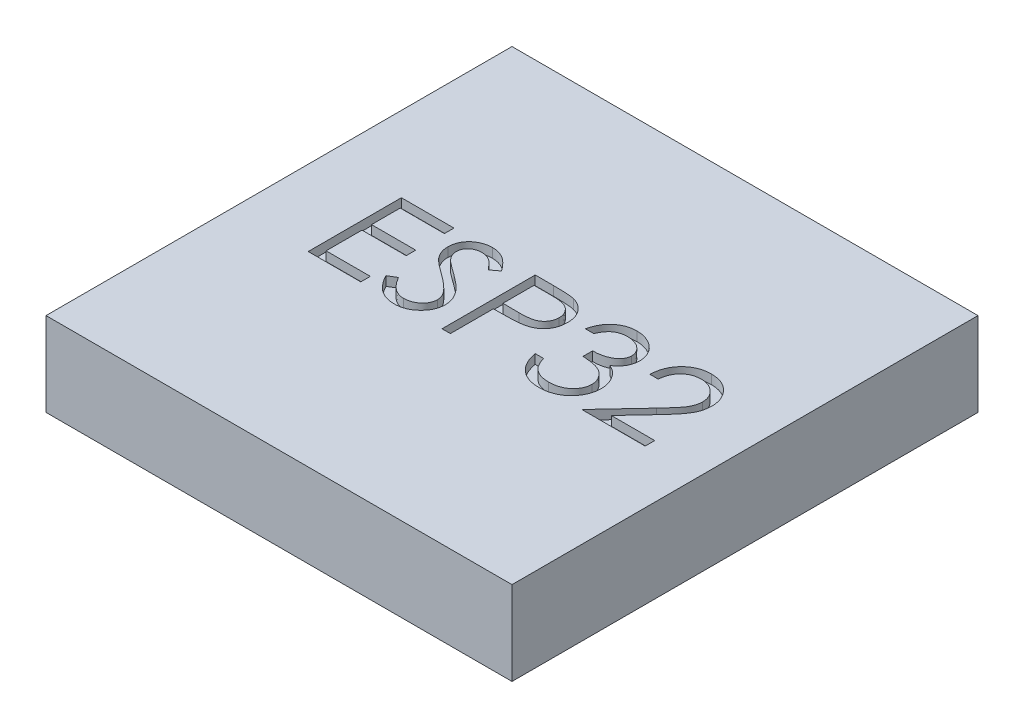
from build123d import *

# Parameters (mm, degrees)
SKETCH1_W           = 5
SKETCH1_H           = 5
BOSS_EXTRUDE1_DEPTH = 0.9
CUT_EXTRUDE1_DEPTH  = 0.1


with BuildPart() as part:
    # Sketch1 → Boss-Extrude1 (new body)
    with BuildSketch(Plane(origin=(0, 0, 0), x_dir=(1, 0, 0), z_dir=(0, 1, 0))):
        Rectangle(SKETCH1_W, SKETCH1_H)
    extrude(amount=BOSS_EXTRUDE1_DEPTH)

    # Sketch2 → Cut-Extrude1 (cut)
    # profile 1 of 5: a face of its own
    with BuildSketch(Plane(origin=(0, 0.9, 0), x_dir=(1, 0, 0), z_dir=(0, 1, 0))):
        Polygon((-1.688543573, 0.501822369), (-1.124441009, 0.501822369), (-1.124441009, 0.399258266), (-1.598799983, 0.399258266), (-1.598799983, 0.091565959), (-1.124441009, 0.091565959), (-1.124441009, -0.010998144), (-1.598799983, -0.010998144), (-1.598799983, -0.395613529), (-1.124441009, -0.395613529), (-1.124441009, -0.498177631), (-1.688543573, -0.498177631), align=None)
    # profile 2 of 5: a face of its own
    with BuildSketch(Plane(origin=(0, 0.9, 0), x_dir=(1, 0, 0), z_dir=(0, 1, 0))):
        with BuildLine():
            Line((-1.047517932, -0.305268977), (-0.962982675, -0.254587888))
            add(Edge.make_bspline(
                [(-0.962982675, -0.254587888), (-0.955120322, -0.26774914), (-0.940056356, -0.292965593), (-0.914927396, -0.327039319), (-0.888889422, -0.355999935), (-0.861749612, -0.379678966), (-0.833673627, -0.398321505), (-0.804478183, -0.411522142), (-0.774261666, -0.419755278), (-0.753697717, -0.420755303), (-0.743431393, -0.421254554)],
                knots=[0, 0, 0, 0, 1.272034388, 2.437168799, 3.508375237, 4.49857839, 5.41946034, 6.295179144, 7.148887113, 8, 8, 8, 8], degree=3))
            add(Edge.make_bspline(
                [(-0.743431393, -0.421254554), (-0.734663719, -0.421010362), (-0.717281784, -0.420526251), (-0.691692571, -0.415874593), (-0.666840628, -0.40872827), (-0.64323816, -0.398493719), (-0.621210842, -0.386111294), (-0.601894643, -0.371155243), (-0.585195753, -0.354410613), (-0.571536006, -0.335729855), (-0.561055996, -0.315639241), (-0.55300112, -0.29501754), (-0.548531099, -0.273540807), (-0.54785774, -0.259080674), (-0.547517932, -0.2517834)],
                knots=[0, 0, 0, 0, 1.095163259, 2.171163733, 3.241058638, 4.321873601, 5.38011039, 6.391990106, 7.366004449, 8.327778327, 9.272591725, 10.192022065, 11.087607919, 12, 12, 12, 12], degree=3))
            add(Edge.make_bspline(
                [(-0.547517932, -0.2517834), (-0.547939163, -0.243457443), (-0.548795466, -0.226531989), (-0.556033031, -0.20156066), (-0.567418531, -0.176848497), (-0.577922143, -0.161562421), (-0.583375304, -0.153626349)],
                knots=[0, 0, 0, 0, 0.938893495, 1.908633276, 2.914225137, 4, 4, 4, 4], degree=3))
            add(Edge.make_bspline(
                [(-0.583375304, -0.153626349), (-0.587852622, -0.147898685), (-0.597252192, -0.135874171), (-0.613411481, -0.117975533), (-0.632373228, -0.099513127), (-0.653488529, -0.079781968), (-0.677526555, -0.059699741), (-0.703734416, -0.038308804), (-0.732781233, -0.016422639), (-0.753152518, -0.001744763), (-0.763663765, 0.005828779)],
                knots=[0, 0, 0, 0, 0.722233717, 1.516239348, 2.393582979, 3.351407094, 4.387010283, 5.505090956, 6.712668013, 8, 8, 8, 8], degree=3))
            add(Edge.make_bspline(
                [(-0.763663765, 0.005828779), (-0.774184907, 0.013322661), (-0.794300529, 0.027650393), (-0.822431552, 0.048914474), (-0.847587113, 0.06835558), (-0.869655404, 0.086156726), (-0.888626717, 0.102320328), (-0.904650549, 0.116691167), (-0.917318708, 0.129657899), (-0.924363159, 0.138069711), (-0.927525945, 0.141846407)],
                knots=[0, 0, 0, 0, 1.452282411, 2.77665338, 3.964542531, 5.026858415, 5.96415736, 6.766646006, 7.446254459, 8, 8, 8, 8], degree=3))
            add(Edge.make_bspline(
                [(-0.927525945, 0.141846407), (-0.931946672, 0.147732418), (-0.940640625, 0.159308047), (-0.952116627, 0.177400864), (-0.961870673, 0.195921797), (-0.969517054, 0.214920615), (-0.975955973, 0.234130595), (-0.980286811, 0.25380238), (-0.982998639, 0.273847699), (-0.983276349, 0.287337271), (-0.983415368, 0.294089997)],
                knots=[0, 0, 0, 0, 1.068054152, 2.10047183, 3.106115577, 4.101338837, 5.06977816, 6.043150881, 7.020423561, 8, 8, 8, 8], degree=3))
            add(Edge.make_bspline(
                [(-0.983415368, 0.294089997), (-0.983042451, 0.304669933), (-0.982304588, 0.325603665), (-0.97606444, 0.356183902), (-0.966215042, 0.385380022), (-0.952416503, 0.412902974), (-0.934628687, 0.438036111), (-0.914044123, 0.461068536), (-0.889526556, 0.480430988), (-0.862625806, 0.497348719), (-0.833181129, 0.510590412), (-0.802326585, 0.520579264), (-0.770013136, 0.526239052), (-0.748126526, 0.52705127), (-0.737021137, 0.527463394)],
                knots=[0, 0, 0, 0, 1.005424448, 1.989358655, 2.955360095, 3.929531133, 4.905563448, 5.876582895, 6.856512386, 7.866279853, 8.892233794, 9.918561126, 10.94386622, 12, 12, 12, 12], degree=3))
            add(Edge.make_bspline(
                [(-0.737021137, 0.527463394), (-0.725237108, 0.527056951), (-0.701802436, 0.526248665), (-0.667331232, 0.519220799), (-0.634142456, 0.507592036), (-0.60744438, 0.494395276), (-0.586549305, 0.481214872), (-0.570614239, 0.469209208), (-0.554466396, 0.455387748), (-0.537975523, 0.439713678), (-0.521421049, 0.422043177), (-0.504557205, 0.402497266), (-0.487344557, 0.381195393), (-0.476271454, 0.365988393), (-0.470594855, 0.358192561)],
                knots=[0, 0, 0, 0, 1.286793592, 2.559021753, 3.825965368, 5.121522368, 5.803751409, 6.523245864, 7.299691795, 8.125521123, 9.008227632, 9.944561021, 10.946284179, 12, 12, 12, 12], degree=3))
            Line((-0.470594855, 0.358192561), (-0.551724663, 0.296694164))
            add(Edge.make_bspline(
                [(-0.551724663, 0.296694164), (-0.5566235, 0.303005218), (-0.566057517, 0.315158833), (-0.580380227, 0.332179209), (-0.593879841, 0.347726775), (-0.607179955, 0.361231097), (-0.619578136, 0.373431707), (-0.631611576, 0.383877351), (-0.643107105, 0.392670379), (-0.657597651, 0.402054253), (-0.675802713, 0.411356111), (-0.698655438, 0.419227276), (-0.722537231, 0.423957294), (-0.73880284, 0.42458269), (-0.747037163, 0.424899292)],
                knots=[0, 0, 0, 0, 1.181633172, 2.275549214, 3.290209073, 4.226197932, 5.078386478, 5.862611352, 6.581680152, 7.217281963, 8.414376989, 9.595101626, 10.782541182, 12, 12, 12, 12], degree=3))
            add(Edge.make_bspline(
                [(-0.747037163, 0.424899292), (-0.757367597, 0.424553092), (-0.777288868, 0.423885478), (-0.805571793, 0.416594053), (-0.8310272, 0.405113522), (-0.852899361, 0.389023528), (-0.871109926, 0.369960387), (-0.884282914, 0.348023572), (-0.892211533, 0.323800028), (-0.893179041, 0.306902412), (-0.893671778, 0.298296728)],
                knots=[0, 0, 0, 0, 1.14458467, 2.207223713, 3.21896685, 4.227309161, 5.202851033, 6.127160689, 7.046193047, 8, 8, 8, 8], degree=3))
            add(Edge.make_bspline(
                [(-0.893671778, 0.298296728), (-0.893559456, 0.292939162), (-0.893334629, 0.282215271), (-0.890198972, 0.266372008), (-0.886170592, 0.250568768), (-0.879786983, 0.234876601), (-0.870974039, 0.21902107), (-0.859401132, 0.202729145), (-0.8448259, 0.185857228), (-0.833661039, 0.174883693), (-0.827766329, 0.169089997)],
                knots=[0, 0, 0, 0, 0.858281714, 1.717966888, 2.583508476, 3.4729293, 4.427298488, 5.488583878, 6.674047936, 8, 8, 8, 8], degree=3))
            add(Edge.make_bspline(
                [(-0.827766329, 0.169089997), (-0.825577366, 0.167136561), (-0.820376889, 0.162495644), (-0.810869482, 0.15489785), (-0.798314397, 0.145525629), (-0.783039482, 0.133929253), (-0.764763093, 0.120477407), (-0.74348322, 0.105342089), (-0.719437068, 0.088031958), (-0.702373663, 0.075929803), (-0.693351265, 0.069530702)],
                knots=[0, 0, 0, 0, 0.420754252, 0.999615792, 1.744751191, 2.668019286, 3.750313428, 4.999500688, 6.413464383, 8, 8, 8, 8], degree=3))
            add(Edge.make_bspline(
                [(-0.693351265, 0.069530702), (-0.682498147, 0.061633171), (-0.661482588, 0.046340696), (-0.631580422, 0.023364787), (-0.604467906, 0.000893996), (-0.580049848, -0.020928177), (-0.558085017, -0.041936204), (-0.538817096, -0.062382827), (-0.522049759, -0.082121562), (-0.503998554, -0.107428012), (-0.485553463, -0.138508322), (-0.469713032, -0.176587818), (-0.459724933, -0.214815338), (-0.458418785, -0.24050872), (-0.457774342, -0.253185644)],
                knots=[0, 0, 0, 0, 1.163667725, 2.253281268, 3.268753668, 4.215851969, 5.092017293, 5.902905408, 6.650798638, 7.335211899, 8.59617414, 9.77448103, 10.901945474, 12, 12, 12, 12], degree=3))
            add(Edge.make_bspline(
                [(-0.457774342, -0.253185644), (-0.457962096, -0.262150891), (-0.458333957, -0.279907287), (-0.462608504, -0.305980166), (-0.468871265, -0.331303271), (-0.478310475, -0.355563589), (-0.489831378, -0.37920495), (-0.504450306, -0.401607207), (-0.521395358, -0.423266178), (-0.540833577, -0.443604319), (-0.562103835, -0.46227466), (-0.58458489, -0.478882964), (-0.60831354, -0.492731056), (-0.633161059, -0.504031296), (-0.659133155, -0.512869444), (-0.686221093, -0.519273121), (-0.714469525, -0.523203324), (-0.733669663, -0.523611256), (-0.743431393, -0.523818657)],
                knots=[0, 0, 0, 0, 0.983748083, 1.948392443, 2.894712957, 3.844097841, 4.80183111, 5.778335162, 6.776009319, 7.81870978, 8.863265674, 9.881300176, 10.883814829, 11.87499822, 12.874611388, 13.892143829, 14.928324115, 16, 16, 16, 16], degree=3))
            add(Edge.make_bspline(
                [(-0.743431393, -0.523818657), (-0.750984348, -0.523672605), (-0.765995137, -0.523382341), (-0.788197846, -0.52081626), (-0.809952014, -0.517185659), (-0.830984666, -0.511421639), (-0.851566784, -0.504428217), (-0.871608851, -0.495817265), (-0.891120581, -0.485498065), (-0.910211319, -0.473699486), (-0.928832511, -0.459968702), (-0.946809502, -0.443976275), (-0.964732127, -0.426163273), (-0.982071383, -0.406045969), (-0.999177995, -0.383949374), (-1.015714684, -0.35966675), (-1.032023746, -0.333330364), (-1.042256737, -0.314797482), (-1.047517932, -0.305268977)],
                knots=[0, 0, 0, 0, 0.915332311, 1.819136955, 2.706846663, 3.586547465, 4.459518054, 5.340707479, 6.227863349, 7.133153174, 8.059268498, 9.028702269, 10.047606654, 11.120612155, 12.245963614, 13.433783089, 14.680604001, 16, 16, 16, 16], degree=3))
        make_face()
    # profile 3 of 5: a face of its own
    with BuildSketch(Plane(origin=(0, 0.9, 0), x_dir=(1, 0, 0), z_dir=(0, 1, 0))):
        with BuildLine():
            Line((-0.252646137, 0.501822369), (-0.056532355, 0.501822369))
            add(Edge.make_bspline(
                [(-0.056532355, 0.501822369), (-0.043043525, 0.501807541), (-0.017198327, 0.501779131), (0.019863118, 0.500917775), (0.053523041, 0.499767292), (0.083708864, 0.498172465), (0.110513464, 0.496287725), (0.133815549, 0.493644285), (0.15379828, 0.490884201), (0.165771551, 0.488078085), (0.171232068, 0.48679833)],
                knots=[0, 0, 0, 0, 1.415646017, 2.712440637, 3.8905458, 4.950247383, 5.884950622, 6.709939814, 7.411656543, 8, 8, 8, 8], degree=3))
            add(Edge.make_bspline(
                [(0.171232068, 0.48679833), (0.178144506, 0.484906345), (0.1918065, 0.481166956), (0.211492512, 0.47367732), (0.230222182, 0.464796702), (0.248059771, 0.454675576), (0.26478608, 0.442879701), (0.280650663, 0.429887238), (0.295513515, 0.415398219), (0.309291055, 0.39957515), (0.321943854, 0.382683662), (0.33283805, 0.364471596), (0.341960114, 0.345245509), (0.349783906, 0.325018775), (0.355414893, 0.303621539), (0.359656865, 0.281202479), (0.36234933, 0.257763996), (0.362607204, 0.241746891), (0.362738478, 0.233593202)],
                knots=[0, 0, 0, 0, 0.999701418, 1.975846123, 2.934577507, 3.890451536, 4.834027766, 5.787354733, 6.749476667, 7.726910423, 8.712836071, 9.690891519, 10.682875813, 11.679750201, 12.712814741, 13.765529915, 14.8625177, 16, 16, 16, 16], degree=3))
            add(Edge.make_bspline(
                [(0.362738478, 0.233593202), (0.362618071, 0.22537098), (0.362382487, 0.209283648), (0.359554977, 0.185748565), (0.355746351, 0.163257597), (0.34989005, 0.141860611), (0.342219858, 0.121684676), (0.333222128, 0.102421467), (0.322369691, 0.084398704), (0.30989974, 0.067550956), (0.296027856, 0.05186241), (0.28081273, 0.037446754), (0.26431579, 0.024388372), (0.246589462, 0.012657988), (0.227460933, 0.002527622), (0.207220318, -0.006545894), (0.185691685, -0.014166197), (0.170793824, -0.018174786), (0.163219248, -0.020212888)],
                knots=[0, 0, 0, 0, 1.121902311, 2.195077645, 3.232258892, 4.234102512, 5.217864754, 6.176164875, 7.132989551, 8.084763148, 9.034132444, 9.988522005, 10.94243251, 11.903244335, 12.886203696, 13.894208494, 14.929344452, 16, 16, 16, 16], degree=3))
            add(Edge.make_bspline(
                [(0.163219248, -0.020212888), (0.156954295, -0.021545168), (0.143224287, -0.024464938), (0.120612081, -0.027724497), (0.094284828, -0.030506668), (0.064278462, -0.032592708), (0.030619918, -0.034378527), (-0.006709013, -0.035797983), (-0.047781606, -0.036577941), (-0.076430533, -0.036618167), (-0.091388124, -0.03663917)],
                knots=[0, 0, 0, 0, 0.601384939, 1.31797006, 2.144135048, 3.087295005, 4.142315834, 5.309527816, 6.595305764, 8, 8, 8, 8], degree=3))
            Line((-0.091388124, -0.03663917), (-0.162902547, -0.03663917))
            Line((-0.162902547, -0.03663917), (-0.162902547, -0.498177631))
            Line((-0.162902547, -0.498177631), (-0.252646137, -0.498177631))
            Line((-0.252646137, -0.498177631), (-0.252646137, 0.501822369))
        make_face()
        with BuildLine():
            Line((-0.162902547, 0.399258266), (-0.162902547, 0.065924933))
            Line((-0.162902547, 0.065924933), (0.012177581, 0.063721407))
            add(Edge.make_bspline(
                [(0.012177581, 0.063721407), (0.020726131, 0.063716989), (0.037228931, 0.06370846), (0.061067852, 0.064847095), (0.083184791, 0.066161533), (0.103511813, 0.068086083), (0.12205808, 0.070806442), (0.138854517, 0.073552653), (0.153770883, 0.077525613), (0.171227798, 0.082875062), (0.190680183, 0.091998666), (0.21184234, 0.105241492), (0.229776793, 0.122121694), (0.245296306, 0.141101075), (0.257612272, 0.162215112), (0.266628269, 0.184806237), (0.271925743, 0.208642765), (0.272636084, 0.224953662), (0.272994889, 0.233192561)],
                knots=[0, 0, 0, 0, 1.160613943, 2.240541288, 3.23993089, 4.169200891, 5.011653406, 5.7853311, 6.478053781, 7.106038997, 8.262395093, 9.384106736, 10.481365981, 11.59014053, 12.70357646, 13.786202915, 14.881775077, 16, 16, 16, 16], degree=3))
            add(Edge.make_bspline(
                [(0.272994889, 0.233192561), (0.272634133, 0.241232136), (0.271916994, 0.257213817), (0.266586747, 0.28063632), (0.257629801, 0.302989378), (0.245213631, 0.323838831), (0.230144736, 0.342749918), (0.212630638, 0.359177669), (0.192712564, 0.37238387), (0.174184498, 0.380907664), (0.157727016, 0.386112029), (0.14343217, 0.389753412), (0.127291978, 0.392660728), (0.109301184, 0.395014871), (0.089599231, 0.397030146), (0.068016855, 0.398397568), (0.044635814, 0.399197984), (0.028404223, 0.399237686), (0.019990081, 0.399258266)],
                knots=[0, 0, 0, 0, 1.120700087, 2.227813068, 3.331159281, 4.466773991, 5.599788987, 6.693661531, 7.80175334, 8.91857717, 9.525282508, 10.207424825, 10.974604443, 11.810962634, 12.737642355, 13.736264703, 14.826523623, 16, 16, 16, 16], degree=3))
            Line((0.019990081, 0.399258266), (-0.162902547, 0.399258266))
        make_face(mode=Mode.SUBTRACT)
    # profile 4 of 5: a face of its own
    with BuildSketch(Plane(origin=(0, 0.9, 0), x_dir=(1, 0, 0), z_dir=(0, 1, 0))):
        with BuildLine():
            Line((0.606328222, 0.271053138), (0.516584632, 0.271053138))
            add(Edge.make_bspline(
                [(0.516584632, 0.271053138), (0.519015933, 0.281119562), (0.523768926, 0.300798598), (0.533682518, 0.328914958), (0.544482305, 0.355521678), (0.557450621, 0.380120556), (0.571595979, 0.403205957), (0.587802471, 0.424254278), (0.605322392, 0.44380084), (0.624700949, 0.461147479), (0.645023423, 0.476855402), (0.666576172, 0.490248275), (0.68892557, 0.501769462), (0.712226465, 0.511260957), (0.736548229, 0.518411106), (0.761670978, 0.523598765), (0.78766055, 0.526967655), (0.805302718, 0.527296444), (0.814260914, 0.527463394)],
                knots=[0, 0, 0, 0, 1.162005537, 2.271625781, 3.343758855, 4.383309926, 5.390229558, 6.379919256, 7.361854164, 8.333198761, 9.295911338, 10.242430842, 11.177959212, 12.116337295, 13.062827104, 14.020064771, 14.994644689, 16, 16, 16, 16], degree=3))
            add(Edge.make_bspline(
                [(0.814260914, 0.527463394), (0.827313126, 0.527069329), (0.853132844, 0.526289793), (0.891065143, 0.519171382), (0.927644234, 0.507907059), (0.962469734, 0.492343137), (0.994817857, 0.473146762), (1.023599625, 0.450299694), (1.048424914, 0.424242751), (1.069251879, 0.395462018), (1.085559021, 0.364703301), (1.097583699, 0.333046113), (1.10490418, 0.30056555), (1.10585291, 0.278634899), (1.106328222, 0.267647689)],
                knots=[0, 0, 0, 0, 1.083050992, 2.142477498, 3.193116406, 4.255571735, 5.30263384, 6.308962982, 7.297363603, 8.282367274, 9.249857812, 10.179914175, 11.08814088, 12, 12, 12, 12], degree=3))
            add(Edge.make_bspline(
                [(1.106328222, 0.267647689), (1.105995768, 0.257074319), (1.105345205, 0.236383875), (1.09982129, 0.206177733), (1.090525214, 0.177708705), (1.077648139, 0.150856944), (1.060979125, 0.125792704), (1.040786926, 0.102459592), (1.016929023, 0.080754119), (0.998849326, 0.068319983), (0.989541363, 0.061918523)],
                knots=[0, 0, 0, 0, 1.024540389, 2.004866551, 2.965041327, 3.920577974, 4.882998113, 5.874504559, 6.905732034, 8, 8, 8, 8], degree=3))
            add(Edge.make_bspline(
                [(0.989541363, 0.061918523), (1.000179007, 0.056781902), (1.021255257, 0.046604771), (1.04998398, 0.026645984), (1.076063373, 0.003601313), (1.090607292, -0.014382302), (1.097914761, -0.023418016)],
                knots=[0, 0, 0, 0, 1.015518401, 2.012035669, 3.001164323, 4, 4, 4, 4], degree=3))
            add(Edge.make_bspline(
                [(1.097914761, -0.023418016), (1.102726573, -0.030005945), (1.1122714, -0.043073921), (1.124052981, -0.064084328), (1.1347413, -0.085327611), (1.143069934, -0.107373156), (1.14951961, -0.129965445), (1.154129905, -0.153143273), (1.156993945, -0.176925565), (1.157404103, -0.193014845), (1.157610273, -0.201102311)],
                knots=[0, 0, 0, 0, 1.025084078, 2.033381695, 3.024893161, 4.013698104, 4.991890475, 5.976764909, 6.982997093, 8, 8, 8, 8], degree=3))
            add(Edge.make_bspline(
                [(1.157610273, -0.201102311), (1.157097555, -0.215105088), (1.156074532, -0.243044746), (1.146930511, -0.284323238), (1.132755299, -0.324673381), (1.112624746, -0.363266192), (1.088091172, -0.399374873), (1.058903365, -0.43168239), (1.025392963, -0.459453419), (0.98801992, -0.482656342), (0.947529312, -0.50120432), (0.904222, -0.514077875), (0.858721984, -0.522462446), (0.827519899, -0.523361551), (0.811656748, -0.523818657)],
                knots=[0, 0, 0, 0, 0.955779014, 1.907060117, 2.875433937, 3.871313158, 4.872415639, 5.851225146, 6.836215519, 7.83643374, 8.849228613, 9.86973379, 10.916971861, 12, 12, 12, 12], degree=3))
            add(Edge.make_bspline(
                [(0.811656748, -0.523818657), (0.800965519, -0.523570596), (0.779928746, -0.523082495), (0.749002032, -0.519745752), (0.719481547, -0.513651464), (0.691327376, -0.50545052), (0.664514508, -0.495052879), (0.639124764, -0.48210468), (0.615001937, -0.466872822), (0.592373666, -0.449177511), (0.571242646, -0.429382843), (0.552170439, -0.407137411), (0.53483907, -0.382852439), (0.519712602, -0.356245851), (0.506102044, -0.327661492), (0.494907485, -0.29673335), (0.485054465, -0.263737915), (0.480473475, -0.240744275), (0.478123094, -0.228946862)],
                knots=[0, 0, 0, 0, 1.048658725, 2.063410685, 3.046034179, 4.001477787, 4.936774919, 5.862367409, 6.792675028, 7.730719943, 8.675894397, 9.627829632, 10.600096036, 11.597688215, 12.626045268, 13.701542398, 14.82072376, 16, 16, 16, 16], degree=3))
            Line((0.478123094, -0.228946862), (0.567866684, -0.228946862))
            add(Edge.make_bspline(
                [(0.567866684, -0.228946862), (0.570204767, -0.23664658), (0.574752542, -0.251623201), (0.58249377, -0.273177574), (0.591313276, -0.292937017), (0.600774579, -0.311046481), (0.610711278, -0.32768431), (0.621829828, -0.342410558), (0.633306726, -0.355872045), (0.64195797, -0.36345622), (0.646192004, -0.367168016)],
                knots=[0, 0, 0, 0, 1.198163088, 2.33053128, 3.407730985, 4.417276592, 5.372219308, 6.28897303, 7.162600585, 8, 8, 8, 8], degree=3))
            add(Edge.make_bspline(
                [(0.646192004, -0.367168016), (0.651791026, -0.371484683), (0.662971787, -0.380104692), (0.681191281, -0.391105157), (0.700352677, -0.400636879), (0.720871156, -0.407917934), (0.742303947, -0.41408298), (0.76499748, -0.418117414), (0.788751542, -0.420885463), (0.804970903, -0.42112973), (0.813259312, -0.421254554)],
                knots=[0, 0, 0, 0, 0.946170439, 1.889420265, 2.845303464, 3.807233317, 4.801018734, 5.828864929, 6.890507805, 8, 8, 8, 8], degree=3))
            add(Edge.make_bspline(
                [(0.813259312, -0.421254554), (0.822617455, -0.421078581), (0.840916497, -0.420734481), (0.867617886, -0.417569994), (0.893020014, -0.412961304), (0.91684085, -0.405843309), (0.939392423, -0.39704878), (0.960358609, -0.386006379), (0.980014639, -0.373050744), (0.998108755, -0.35832527), (1.0143789, -0.342204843), (1.028704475, -0.325343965), (1.04088295, -0.307813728), (1.050706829, -0.289517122), (1.058464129, -0.270529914), (1.063745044, -0.25079882), (1.067416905, -0.230485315), (1.067715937, -0.216677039), (1.067866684, -0.209716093)],
                knots=[0, 0, 0, 0, 1.217147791, 2.380027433, 3.494444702, 4.572153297, 5.609568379, 6.639424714, 7.649109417, 8.668170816, 9.669597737, 10.625200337, 11.543417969, 12.441394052, 13.322311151, 14.205496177, 15.095365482, 16, 16, 16, 16], degree=3))
            add(Edge.make_bspline(
                [(1.067866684, -0.209716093), (1.067429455, -0.200398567), (1.066557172, -0.181809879), (1.059897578, -0.154462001), (1.048943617, -0.128112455), (1.033608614, -0.1032108), (1.014941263, -0.080131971), (0.993122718, -0.059540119), (0.967971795, -0.042548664), (0.944823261, -0.030809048), (0.924318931, -0.022798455), (0.906771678, -0.017462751), (0.887126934, -0.012944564), (0.865622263, -0.008741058), (0.84209563, -0.00516353), (0.816572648, -0.002180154), (0.789048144, 0.000207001), (0.769993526, 0.001273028), (0.760174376, 0.001822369)],
                knots=[0, 0, 0, 0, 1.07054697, 2.135767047, 3.216561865, 4.33974944, 5.486079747, 6.621378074, 7.775625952, 8.963672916, 9.598146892, 10.304877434, 11.070270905, 11.915000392, 12.823868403, 13.805723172, 14.86925407, 16, 16, 16, 16], degree=3))
            Line((0.760174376, 0.001822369), (0.760174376, 0.104386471))
            add(Edge.make_bspline(
                [(0.760174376, 0.104386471), (0.772546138, 0.104596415), (0.796779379, 0.105007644), (0.832177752, 0.109981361), (0.86602727, 0.116861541), (0.897577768, 0.127400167), (0.926334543, 0.139640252), (0.951283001, 0.15388374), (0.972073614, 0.169716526), (0.988605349, 0.187382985), (1.001042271, 0.206330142), (1.010135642, 0.226077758), (1.015507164, 0.246798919), (1.016224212, 0.260940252), (1.016584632, 0.26804833)],
                knots=[0, 0, 0, 0, 1.321986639, 2.589447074, 3.816329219, 5.01088745, 6.139805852, 7.153945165, 8.075214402, 8.924034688, 9.728124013, 10.488707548, 11.240355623, 12, 12, 12, 12], degree=3))
            add(Edge.make_bspline(
                [(1.016584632, 0.26804833), (1.016466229, 0.273270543), (1.016230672, 0.283659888), (1.013260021, 0.298838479), (1.008796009, 0.313553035), (1.002658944, 0.327740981), (0.994444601, 0.341303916), (0.984614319, 0.354357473), (0.972909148, 0.366827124), (0.959496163, 0.378450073), (0.94509279, 0.389526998), (0.92930714, 0.398930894), (0.912615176, 0.40697234), (0.894998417, 0.413603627), (0.876399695, 0.418591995), (0.856906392, 0.422173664), (0.83648134, 0.424412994), (0.822546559, 0.424735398), (0.815462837, 0.424899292)],
                knots=[0, 0, 0, 0, 0.884392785, 1.759457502, 2.611959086, 3.489218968, 4.37281399, 5.2945488, 6.255912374, 7.266815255, 8.301784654, 9.332968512, 10.37626691, 11.440494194, 12.520033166, 13.637162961, 14.798855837, 16, 16, 16, 16], degree=3))
            add(Edge.make_bspline(
                [(0.815462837, 0.424899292), (0.804076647, 0.42450176), (0.781836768, 0.423725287), (0.749775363, 0.416924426), (0.719969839, 0.406073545), (0.697187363, 0.393121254), (0.68036377, 0.380335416), (0.668341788, 0.36916902), (0.656535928, 0.356759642), (0.645722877, 0.342342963), (0.634787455, 0.326895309), (0.624831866, 0.3096314), (0.615157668, 0.291001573), (0.609328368, 0.277831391), (0.606328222, 0.271053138)],
                knots=[0, 0, 0, 0, 1.472543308, 2.876219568, 4.221790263, 5.565193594, 6.249813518, 6.953379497, 7.687249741, 8.463570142, 9.283606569, 10.136032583, 11.040678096, 12, 12, 12, 12], degree=3))
        make_face()
    # profile 5 of 5: a face of its own
    with BuildSketch(Plane(origin=(0, 0.9, 0), x_dir=(1, 0, 0), z_dir=(0, 1, 0))):
        with BuildLine():
            Line((1.375558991, 0.194130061), (1.285815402, 0.194130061))
            add(Edge.make_bspline(
                [(1.285815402, 0.194130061), (1.286400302, 0.206036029), (1.287549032, 0.229419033), (1.292928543, 0.263511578), (1.300625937, 0.296098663), (1.311509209, 0.326918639), (1.325025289, 0.356244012), (1.341233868, 0.383958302), (1.360432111, 0.409955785), (1.382205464, 0.433995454), (1.405853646, 0.456049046), (1.431369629, 0.475093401), (1.458182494, 0.491184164), (1.486210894, 0.504635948), (1.515771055, 0.514733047), (1.546594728, 0.522224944), (1.578817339, 0.526732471), (1.600771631, 0.527216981), (1.611937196, 0.527463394)],
                knots=[0, 0, 0, 0, 1.10065271, 2.161652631, 3.183658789, 4.190468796, 5.17591951, 6.163126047, 7.15150782, 8.156236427, 9.156009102, 10.134482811, 11.092018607, 12.041330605, 13.001268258, 13.972401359, 14.968799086, 16, 16, 16, 16], degree=3))
            add(Edge.make_bspline(
                [(1.611937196, 0.527463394), (1.62290236, 0.527206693), (1.644448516, 0.526702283), (1.675894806, 0.52237056), (1.705831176, 0.515586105), (1.734199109, 0.506067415), (1.76077227, 0.493271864), (1.785750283, 0.477901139), (1.809430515, 0.460124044), (1.830746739, 0.439194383), (1.850320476, 0.416850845), (1.867206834, 0.392997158), (1.881667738, 0.368360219), (1.893721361, 0.342752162), (1.902594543, 0.315931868), (1.909331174, 0.28828981), (1.913139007, 0.259539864), (1.913723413, 0.240080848), (1.91402053, 0.230187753)],
                knots=[0, 0, 0, 0, 1.111607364, 2.184268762, 3.212621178, 4.221274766, 5.211760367, 6.196651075, 7.1921475, 8.207485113, 9.220403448, 10.201281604, 11.166441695, 12.114753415, 13.065576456, 14.026450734, 14.996634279, 16, 16, 16, 16], degree=3))
            add(Edge.make_bspline(
                [(1.91402053, 0.230187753), (1.913538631, 0.216259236), (1.912583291, 0.188646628), (1.904338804, 0.148016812), (1.891601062, 0.108615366), (1.876151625, 0.076907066), (1.860545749, 0.051485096), (1.846780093, 0.030366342), (1.830307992, 0.007844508), (1.81128016, -0.016307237), (1.789983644, -0.042162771), (1.766265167, -0.069732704), (1.739943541, -0.09872422), (1.721469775, -0.118525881), (1.711897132, -0.128786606)],
                knots=[0, 0, 0, 0, 1.184203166, 2.347625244, 3.513805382, 4.700623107, 5.337941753, 6.051866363, 6.845199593, 7.711357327, 8.668078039, 9.695487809, 10.805859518, 12, 12, 12, 12], degree=3))
            Line((1.711897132, -0.128786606), (1.461696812, -0.395613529))
            Line((1.461696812, -0.395613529), (1.926841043, -0.395613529))
            Line((1.926841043, -0.395613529), (1.926841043, -0.498177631))
            Line((1.926841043, -0.498177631), (1.247353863, -0.498177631))
            Line((1.247353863, -0.498177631), (1.635174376, -0.084315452))
            add(Edge.make_bspline(
                [(1.635174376, -0.084315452), (1.644616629, -0.074458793), (1.662753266, -0.055526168), (1.68840543, -0.027885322), (1.711445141, -0.002242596), (1.732021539, 0.02135356), (1.749688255, 0.043248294), (1.765366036, 0.062732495), (1.777927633, 0.080662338), (1.791560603, 0.101445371), (1.804764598, 0.126820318), (1.816110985, 0.157829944), (1.823029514, 0.189752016), (1.823859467, 0.211324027), (1.82427694, 0.222174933)],
                knots=[0, 0, 0, 0, 1.329631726, 2.553950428, 3.673215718, 4.687767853, 5.603093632, 6.413772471, 7.123043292, 7.734684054, 8.834405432, 9.900288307, 10.943827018, 12, 12, 12, 12], degree=3))
            add(Edge.make_bspline(
                [(1.82427694, 0.222174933), (1.824095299, 0.22899819), (1.823737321, 0.242445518), (1.820577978, 0.262161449), (1.815803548, 0.281179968), (1.808962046, 0.299559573), (1.799931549, 0.317115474), (1.788939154, 0.333869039), (1.776256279, 0.350065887), (1.761584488, 0.365252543), (1.745466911, 0.379161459), (1.728439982, 0.391482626), (1.710425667, 0.401779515), (1.691499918, 0.410220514), (1.671715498, 0.416842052), (1.651034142, 0.421430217), (1.629512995, 0.424310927), (1.61481771, 0.42470069), (1.607329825, 0.424899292)],
                knots=[0, 0, 0, 0, 0.991446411, 1.95395049, 2.89581595, 3.838931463, 4.798493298, 5.75982156, 6.748411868, 7.785213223, 8.824556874, 9.840280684, 10.836137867, 11.835679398, 12.848801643, 13.863922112, 14.911575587, 16, 16, 16, 16], degree=3))
            add(Edge.make_bspline(
                [(1.607329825, 0.424899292), (1.599509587, 0.424694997), (1.584151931, 0.424293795), (1.561603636, 0.42148732), (1.540093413, 0.416645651), (1.519567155, 0.410023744), (1.499990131, 0.401607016), (1.481457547, 0.39112366), (1.464011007, 0.378614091), (1.447617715, 0.364431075), (1.432513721, 0.348640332), (1.419243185, 0.331037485), (1.407647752, 0.311943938), (1.397530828, 0.291411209), (1.389314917, 0.269252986), (1.383036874, 0.245547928), (1.378069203, 0.220398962), (1.376409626, 0.203031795), (1.375558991, 0.194130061)],
                knots=[0, 0, 0, 0, 1.031018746, 2.02475058, 2.990194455, 3.934040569, 4.864654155, 5.795059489, 6.735614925, 7.690564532, 8.649604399, 9.611025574, 10.590972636, 11.591080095, 12.624614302, 13.701020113, 14.821632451, 16, 16, 16, 16], degree=3))
        make_face()
    extrude(amount=-CUT_EXTRUDE1_DEPTH, mode=Mode.SUBTRACT)


solid = part.part
